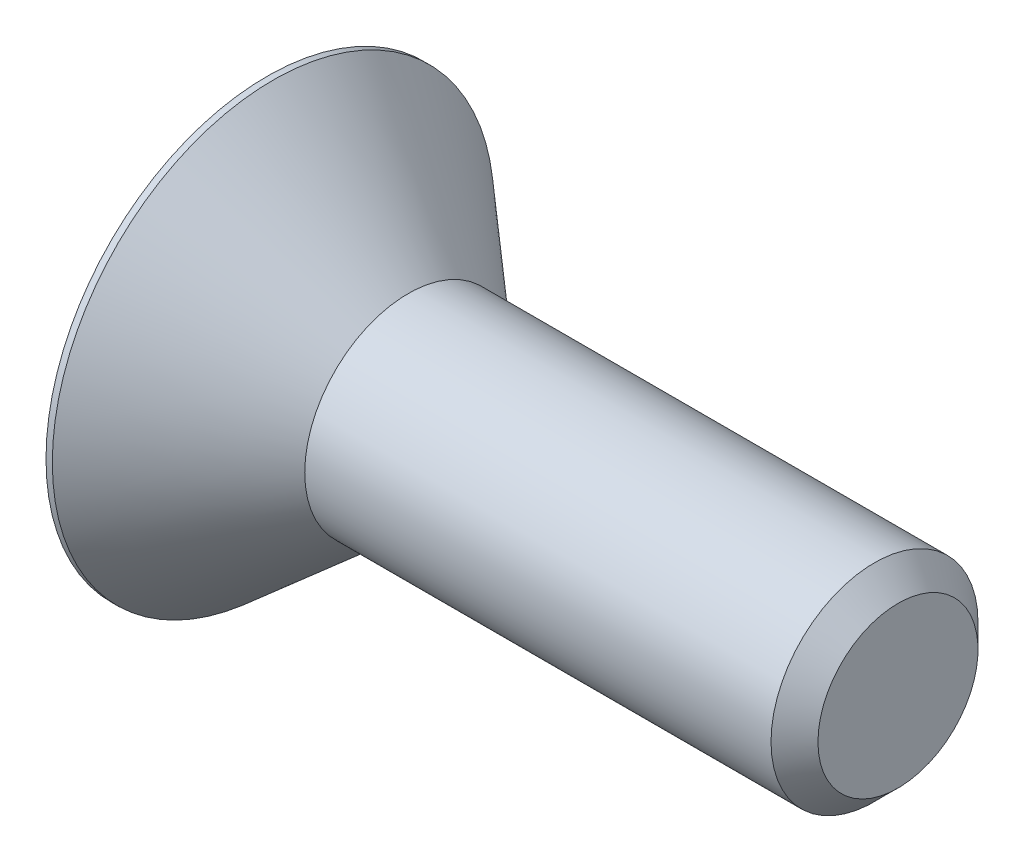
ISO-10303-21;
HEADER;
FILE_DESCRIPTION(('STEP AP214'),'2;1');
FILE_NAME('part.step','',(''),(''),'','','');
FILE_SCHEMA(('AUTOMOTIVE_DESIGN { 1 0 10303 214 1 1 1 1 }'));
ENDSEC;
DATA;
#1=APPLICATION_CONTEXT('core data for automotive mechanical design processes');
#2=APPLICATION_PROTOCOL_DEFINITION('international standard','automotive_design',2000,#1);
#3=PRODUCT_CONTEXT('',#1,'mechanical');
#4=PRODUCT('Part','Part','',(#3));
#5=PRODUCT_RELATED_PRODUCT_CATEGORY('part','',(#4));
#6=PRODUCT_DEFINITION_FORMATION('','',#4);
#7=PRODUCT_DEFINITION_CONTEXT('part definition',#1,'design');
#8=PRODUCT_DEFINITION('design','',#6,#7);
#9=PRODUCT_DEFINITION_SHAPE('','',#8);
#10=(LENGTH_UNIT() NAMED_UNIT(*) SI_UNIT(.MILLI.,.METRE.));
#11=(NAMED_UNIT(*) PLANE_ANGLE_UNIT() SI_UNIT($,.RADIAN.));
#12=(NAMED_UNIT(*) SI_UNIT($,.STERADIAN.) SOLID_ANGLE_UNIT());
#13=UNCERTAINTY_MEASURE_WITH_UNIT(LENGTH_MEASURE(1.E-05),#10,'distance_accuracy_value','');
#14=(GEOMETRIC_REPRESENTATION_CONTEXT(3) GLOBAL_UNCERTAINTY_ASSIGNED_CONTEXT((#13)) GLOBAL_UNIT_ASSIGNED_CONTEXT((#10,
#11,#12)) REPRESENTATION_CONTEXT('',''));
#15=CARTESIAN_POINT('',(0.,0.,0.));
#16=DIRECTION('',(0.,0.,1.));
#17=DIRECTION('',(1.,0.,0.));
#18=AXIS2_PLACEMENT_3D('',#15,#16,#17);
#19=CARTESIAN_POINT('',(0.,0.,0.));
#20=DIRECTION('',(-1.,0.,0.));
#21=DIRECTION('',(0.,0.,1.));
#22=AXIS2_PLACEMENT_3D('',#19,#20,#21);
#23=PLANE('',#22);
#24=CARTESIAN_POINT('',(0.,0.,0.));
#25=DIRECTION('',(-1.,0.,0.));
#26=DIRECTION('',(0.,0.,1.));
#27=AXIS2_PLACEMENT_3D('',#24,#25,#26);
#28=CIRCLE('',#27,4.445);
#29=CARTESIAN_POINT('',(0.,0.,4.445));
#30=VERTEX_POINT('',#29);
#31=EDGE_CURVE('E11',#30,#30,#28,.T.);
#32=ORIENTED_EDGE('',*,*,#31,.T.);
#33=EDGE_LOOP('',(#32));
#34=FACE_BOUND('',#33,.T.);
#35=DIRECTION('',(0.,-0.5,-0.866025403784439));
#36=VECTOR('',#35,1.);
#37=CARTESIAN_POINT('',(0.,-0.689240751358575,1.1938));
#38=LINE('',#37,#36);
#39=CARTESIAN_POINT('',(0.,-0.689240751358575,1.1938));
#40=VERTEX_POINT('',#39);
#41=CARTESIAN_POINT('',(0.,-1.37848150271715,0.));
#42=VERTEX_POINT('',#41);
#43=EDGE_CURVE('E116',#40,#42,#38,.T.);
#44=ORIENTED_EDGE('',*,*,#43,.T.);
#45=DIRECTION('',(0.,0.5,-0.866025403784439));
#46=VECTOR('',#45,1.);
#47=CARTESIAN_POINT('',(0.,-1.37848150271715,0.));
#48=LINE('',#47,#46);
#49=CARTESIAN_POINT('',(0.,-0.689240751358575,-1.1938));
#50=VERTEX_POINT('',#49);
#51=EDGE_CURVE('E47',#42,#50,#48,.T.);
#52=ORIENTED_EDGE('',*,*,#51,.T.);
#53=DIRECTION('',(0.,1.,0.));
#54=VECTOR('',#53,1.);
#55=CARTESIAN_POINT('',(0.,-0.689240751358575,-1.1938));
#56=LINE('',#55,#54);
#57=CARTESIAN_POINT('',(0.,0.689240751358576,-1.1938));
#58=VERTEX_POINT('',#57);
#59=EDGE_CURVE('E127',#50,#58,#56,.T.);
#60=ORIENTED_EDGE('',*,*,#59,.T.);
#61=DIRECTION('',(0.,0.5,0.866025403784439));
#62=VECTOR('',#61,1.);
#63=CARTESIAN_POINT('',(0.,0.689240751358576,-1.1938));
#64=LINE('',#63,#62);
#65=CARTESIAN_POINT('',(0.,1.37848150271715,0.));
#66=VERTEX_POINT('',#65);
#67=EDGE_CURVE('E198',#58,#66,#64,.T.);
#68=ORIENTED_EDGE('',*,*,#67,.T.);
#69=DIRECTION('',(0.,-0.5,0.866025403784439));
#70=VECTOR('',#69,1.);
#71=CARTESIAN_POINT('',(0.,1.37848150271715,0.));
#72=LINE('',#71,#70);
#73=CARTESIAN_POINT('',(0.,0.689240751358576,1.1938));
#74=VERTEX_POINT('',#73);
#75=EDGE_CURVE('E181',#66,#74,#72,.T.);
#76=ORIENTED_EDGE('',*,*,#75,.T.);
#77=DIRECTION('',(0.,-1.,0.));
#78=VECTOR('',#77,1.);
#79=CARTESIAN_POINT('',(0.,0.689240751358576,1.1938));
#80=LINE('',#79,#78);
#81=EDGE_CURVE('E176',#74,#40,#80,.T.);
#82=ORIENTED_EDGE('',*,*,#81,.T.);
#83=EDGE_LOOP('',(#44,#52,#60,#68,#76,#82));
#84=FACE_BOUND('',#83,.T.);
#85=ADVANCED_FACE('F33',(#34,#84),#23,.T.);
#86=CARTESIAN_POINT('',(0.,0.,0.));
#87=DIRECTION('',(-1.,0.,0.));
#88=DIRECTION('',(0.,0.,1.));
#89=AXIS2_PLACEMENT_3D('',#86,#87,#88);
#90=CYLINDRICAL_SURFACE('',#89,4.445);
#91=CARTESIAN_POINT('',(0.127,0.,0.));
#92=DIRECTION('',(-1.,0.,0.));
#93=DIRECTION('',(0.,0.,1.));
#94=AXIS2_PLACEMENT_3D('',#91,#92,#93);
#95=CIRCLE('',#94,4.445);
#96=CARTESIAN_POINT('',(0.127,0.,4.445));
#97=VERTEX_POINT('',#96);
#98=EDGE_CURVE('E40',#97,#97,#95,.T.);
#99=ORIENTED_EDGE('',*,*,#98,.T.);
#100=EDGE_LOOP('',(#99));
#101=FACE_BOUND('',#100,.T.);
#102=ORIENTED_EDGE('',*,*,#31,.F.);
#103=EDGE_LOOP('',(#102));
#104=FACE_BOUND('',#103,.T.);
#105=ADVANCED_FACE('F152',(#101,#104),#90,.T.);
#106=CARTESIAN_POINT('',(0.127,0.,0.));
#107=DIRECTION('',(-1.,0.,0.));
#108=DIRECTION('',(0.,0.,1.));
#109=AXIS2_PLACEMENT_3D('',#106,#107,#108);
#110=CONICAL_SURFACE('',#109,4.445,0.715584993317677);
#111=CARTESIAN_POINT('',(2.84440025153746,0.,0.));
#112=DIRECTION('',(-1.,0.,0.));
#113=DIRECTION('',(0.,0.,1.));
#114=AXIS2_PLACEMENT_3D('',#111,#112,#113);
#115=CIRCLE('',#114,2.0828);
#116=CARTESIAN_POINT('',(2.84440025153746,0.,2.0828));
#117=VERTEX_POINT('',#116);
#118=EDGE_CURVE('E147',#117,#117,#115,.T.);
#119=ORIENTED_EDGE('',*,*,#118,.T.);
#120=EDGE_LOOP('',(#119));
#121=FACE_BOUND('',#120,.T.);
#122=ORIENTED_EDGE('',*,*,#98,.F.);
#123=EDGE_LOOP('',(#122));
#124=FACE_BOUND('',#123,.T.);
#125=ADVANCED_FACE('F155',(#121,#124),#110,.T.);
#126=CARTESIAN_POINT('',(0.,0.,0.));
#127=DIRECTION('',(-1.,0.,0.));
#128=DIRECTION('',(0.,0.,1.));
#129=AXIS2_PLACEMENT_3D('',#126,#127,#128);
#130=CYLINDRICAL_SURFACE('',#129,2.08279999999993);
#131=CARTESIAN_POINT('',(12.2275599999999,0.,0.));
#132=DIRECTION('',(-1.,0.,0.));
#133=DIRECTION('',(0.,0.,1.));
#134=AXIS2_PLACEMENT_3D('',#131,#132,#133);
#135=CIRCLE('',#134,2.08279999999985);
#136=CARTESIAN_POINT('',(12.2275599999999,0.,2.08279999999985));
#137=VERTEX_POINT('',#136);
#138=EDGE_CURVE('E144',#137,#137,#135,.T.);
#139=ORIENTED_EDGE('',*,*,#138,.T.);
#140=EDGE_LOOP('',(#139));
#141=FACE_BOUND('',#140,.T.);
#142=ORIENTED_EDGE('',*,*,#118,.F.);
#143=EDGE_LOOP('',(#142));
#144=FACE_BOUND('',#143,.T.);
#145=ADVANCED_FACE('F157',(#141,#144),#130,.T.);
#146=CARTESIAN_POINT('',(12.7,0.,0.));
#147=DIRECTION('',(-1.,0.,0.));
#148=DIRECTION('',(0.,0.,1.));
#149=AXIS2_PLACEMENT_3D('',#146,#147,#148);
#150=CONICAL_SURFACE('',#149,1.61036,0.785398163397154);
#151=ORIENTED_EDGE('',*,*,#138,.F.);
#152=EDGE_LOOP('',(#151));
#153=FACE_BOUND('',#152,.T.);
#154=CARTESIAN_POINT('',(12.7,0.,0.));
#155=DIRECTION('',(-1.,0.,0.));
#156=DIRECTION('',(0.,0.,1.));
#157=AXIS2_PLACEMENT_3D('',#154,#155,#156);
#158=CIRCLE('',#157,1.61036);
#159=CARTESIAN_POINT('',(12.7,0.,1.61036));
#160=VERTEX_POINT('',#159);
#161=EDGE_CURVE('E140',#160,#160,#158,.T.);
#162=ORIENTED_EDGE('',*,*,#161,.T.);
#163=EDGE_LOOP('',(#162));
#164=FACE_BOUND('',#163,.T.);
#165=ADVANCED_FACE('F164',(#153,#164),#150,.T.);
#166=CARTESIAN_POINT('',(12.7,1.61036,0.));
#167=DIRECTION('',(1.,0.,0.));
#168=DIRECTION('',(0.,0.,-1.));
#169=AXIS2_PLACEMENT_3D('',#166,#167,#168);
#170=PLANE('',#169);
#171=ORIENTED_EDGE('',*,*,#161,.F.);
#172=EDGE_LOOP('',(#171));
#173=FACE_BOUND('',#172,.T.);
#174=ADVANCED_FACE('F264',(#173),#170,.T.);
#175=CARTESIAN_POINT('',(1.9304,-1.37848150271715,0.));
#176=DIRECTION('',(0.,0.866025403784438,0.5));
#177=DIRECTION('',(0.,-0.5,0.866025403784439));
#178=AXIS2_PLACEMENT_3D('',#175,#176,#177);
#179=PLANE('',#178);
#180=ORIENTED_EDGE('',*,*,#51,.F.);
#181=DIRECTION('',(-1.,0.,0.));
#182=VECTOR('',#181,1.);
#183=CARTESIAN_POINT('',(1.9304,-1.37848150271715,0.));
#184=LINE('',#183,#182);
#185=CARTESIAN_POINT('',(1.9304,-1.37848150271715,0.));
#186=VERTEX_POINT('',#185);
#187=EDGE_CURVE('E185',#186,#42,#184,.T.);
#188=ORIENTED_EDGE('',*,*,#187,.F.);
#189=DIRECTION('',(0.,0.5,-0.866025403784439));
#190=VECTOR('',#189,1.);
#191=CARTESIAN_POINT('',(1.9304,-1.37848150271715,0.));
#192=LINE('',#191,#190);
#193=CARTESIAN_POINT('',(1.9304,-1.03386112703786,-0.5969));
#194=VERTEX_POINT('',#193);
#195=EDGE_CURVE('E112',#186,#194,#192,.T.);
#196=ORIENTED_EDGE('',*,*,#195,.T.);
#197=CARTESIAN_POINT('',(1.9304,-0.689240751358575,-1.1938));
#198=VERTEX_POINT('',#197);
#199=EDGE_CURVE('E108',#194,#198,#192,.T.);
#200=ORIENTED_EDGE('',*,*,#199,.T.);
#201=DIRECTION('',(-1.,0.,0.));
#202=VECTOR('',#201,1.);
#203=CARTESIAN_POINT('',(1.9304,-0.689240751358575,-1.1938));
#204=LINE('',#203,#202);
#205=EDGE_CURVE('E110',#198,#50,#204,.T.);
#206=ORIENTED_EDGE('',*,*,#205,.T.);
#207=EDGE_LOOP('',(#180,#188,#196,#200,#206));
#208=FACE_BOUND('',#207,.T.);
#209=ADVANCED_FACE('F109',(#208),#179,.T.);
#210=CARTESIAN_POINT('',(1.9304,-0.689240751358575,-1.1938));
#211=DIRECTION('',(0.,0.,1.));
#212=DIRECTION('',(1.,0.,0.));
#213=AXIS2_PLACEMENT_3D('',#210,#211,#212);
#214=PLANE('',#213);
#215=ORIENTED_EDGE('',*,*,#59,.F.);
#216=ORIENTED_EDGE('',*,*,#205,.F.);
#217=DIRECTION('',(0.,1.,0.));
#218=VECTOR('',#217,1.);
#219=CARTESIAN_POINT('',(1.9304,-0.689240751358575,-1.1938));
#220=LINE('',#219,#218);
#221=CARTESIAN_POINT('',(1.9304,0.,-1.1938));
#222=VERTEX_POINT('',#221);
#223=EDGE_CURVE('E55',#198,#222,#220,.T.);
#224=ORIENTED_EDGE('',*,*,#223,.T.);
#225=CARTESIAN_POINT('',(1.9304,0.689240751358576,-1.1938));
#226=VERTEX_POINT('',#225);
#227=EDGE_CURVE('E122',#222,#226,#220,.T.);
#228=ORIENTED_EDGE('',*,*,#227,.T.);
#229=DIRECTION('',(-1.,0.,0.));
#230=VECTOR('',#229,1.);
#231=CARTESIAN_POINT('',(1.9304,0.689240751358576,-1.1938));
#232=LINE('',#231,#230);
#233=EDGE_CURVE('E129',#226,#58,#232,.T.);
#234=ORIENTED_EDGE('',*,*,#233,.T.);
#235=EDGE_LOOP('',(#215,#216,#224,#228,#234));
#236=FACE_BOUND('',#235,.T.);
#237=ADVANCED_FACE('F124',(#236),#214,.T.);
#238=CARTESIAN_POINT('',(1.9304,0.689240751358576,-1.1938));
#239=DIRECTION('',(0.,-0.866025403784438,0.5));
#240=DIRECTION('',(0.,-0.5,-0.866025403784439));
#241=AXIS2_PLACEMENT_3D('',#238,#239,#240);
#242=PLANE('',#241);
#243=ORIENTED_EDGE('',*,*,#67,.F.);
#244=ORIENTED_EDGE('',*,*,#233,.F.);
#245=DIRECTION('',(0.,0.5,0.866025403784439));
#246=VECTOR('',#245,1.);
#247=CARTESIAN_POINT('',(1.9304,0.689240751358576,-1.1938));
#248=LINE('',#247,#246);
#249=CARTESIAN_POINT('',(1.9304,1.03386112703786,-0.5969));
#250=VERTEX_POINT('',#249);
#251=EDGE_CURVE('E218',#226,#250,#248,.T.);
#252=ORIENTED_EDGE('',*,*,#251,.T.);
#253=CARTESIAN_POINT('',(1.9304,1.37848150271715,0.));
#254=VERTEX_POINT('',#253);
#255=EDGE_CURVE('E121',#250,#254,#248,.T.);
#256=ORIENTED_EDGE('',*,*,#255,.T.);
#257=DIRECTION('',(-1.,0.,0.));
#258=VECTOR('',#257,1.);
#259=CARTESIAN_POINT('',(1.9304,1.37848150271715,0.));
#260=LINE('',#259,#258);
#261=EDGE_CURVE('E135',#254,#66,#260,.T.);
#262=ORIENTED_EDGE('',*,*,#261,.T.);
#263=EDGE_LOOP('',(#243,#244,#252,#256,#262));
#264=FACE_BOUND('',#263,.T.);
#265=ADVANCED_FACE('F196',(#264),#242,.T.);
#266=CARTESIAN_POINT('',(1.9304,1.37848150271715,0.));
#267=DIRECTION('',(0.,-0.866025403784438,-0.5));
#268=DIRECTION('',(0.,0.5,-0.866025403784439));
#269=AXIS2_PLACEMENT_3D('',#266,#267,#268);
#270=PLANE('',#269);
#271=ORIENTED_EDGE('',*,*,#75,.F.);
#272=ORIENTED_EDGE('',*,*,#261,.F.);
#273=DIRECTION('',(0.,-0.5,0.866025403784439));
#274=VECTOR('',#273,1.);
#275=CARTESIAN_POINT('',(1.9304,1.37848150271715,0.));
#276=LINE('',#275,#274);
#277=CARTESIAN_POINT('',(1.9304,1.03386112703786,0.5969));
#278=VERTEX_POINT('',#277);
#279=EDGE_CURVE('E215',#254,#278,#276,.T.);
#280=ORIENTED_EDGE('',*,*,#279,.T.);
#281=CARTESIAN_POINT('',(1.9304,0.689240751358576,1.1938));
#282=VERTEX_POINT('',#281);
#283=EDGE_CURVE('E217',#278,#282,#276,.T.);
#284=ORIENTED_EDGE('',*,*,#283,.T.);
#285=DIRECTION('',(-1.,0.,0.));
#286=VECTOR('',#285,1.);
#287=CARTESIAN_POINT('',(1.9304,0.689240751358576,1.1938));
#288=LINE('',#287,#286);
#289=EDGE_CURVE('E190',#282,#74,#288,.T.);
#290=ORIENTED_EDGE('',*,*,#289,.T.);
#291=EDGE_LOOP('',(#271,#272,#280,#284,#290));
#292=FACE_BOUND('',#291,.T.);
#293=ADVANCED_FACE('F228',(#292),#270,.T.);
#294=CARTESIAN_POINT('',(1.9304,0.689240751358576,1.1938));
#295=DIRECTION('',(0.,0.,-1.));
#296=DIRECTION('',(-1.,0.,0.));
#297=AXIS2_PLACEMENT_3D('',#294,#295,#296);
#298=PLANE('',#297);
#299=ORIENTED_EDGE('',*,*,#81,.F.);
#300=ORIENTED_EDGE('',*,*,#289,.F.);
#301=DIRECTION('',(0.,-1.,0.));
#302=VECTOR('',#301,1.);
#303=CARTESIAN_POINT('',(1.9304,0.689240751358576,1.1938));
#304=LINE('',#303,#302);
#305=CARTESIAN_POINT('',(1.9304,0.,1.1938));
#306=VERTEX_POINT('',#305);
#307=EDGE_CURVE('E211',#282,#306,#304,.T.);
#308=ORIENTED_EDGE('',*,*,#307,.T.);
#309=CARTESIAN_POINT('',(1.9304,-0.689240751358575,1.1938));
#310=VERTEX_POINT('',#309);
#311=EDGE_CURVE('E214',#306,#310,#304,.T.);
#312=ORIENTED_EDGE('',*,*,#311,.T.);
#313=DIRECTION('',(-1.,0.,0.));
#314=VECTOR('',#313,1.);
#315=CARTESIAN_POINT('',(1.9304,-0.689240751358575,1.1938));
#316=LINE('',#315,#314);
#317=EDGE_CURVE('E187',#310,#40,#316,.T.);
#318=ORIENTED_EDGE('',*,*,#317,.T.);
#319=EDGE_LOOP('',(#299,#300,#308,#312,#318));
#320=FACE_BOUND('',#319,.T.);
#321=ADVANCED_FACE('F241',(#320),#298,.T.);
#322=CARTESIAN_POINT('',(1.9304,-0.689240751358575,1.1938));
#323=DIRECTION('',(0.,0.866025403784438,-0.5));
#324=DIRECTION('',(0.,0.5,0.866025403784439));
#325=AXIS2_PLACEMENT_3D('',#322,#323,#324);
#326=PLANE('',#325);
#327=ORIENTED_EDGE('',*,*,#43,.F.);
#328=ORIENTED_EDGE('',*,*,#317,.F.);
#329=DIRECTION('',(0.,-0.5,-0.866025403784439));
#330=VECTOR('',#329,1.);
#331=CARTESIAN_POINT('',(1.9304,-0.689240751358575,1.1938));
#332=LINE('',#331,#330);
#333=CARTESIAN_POINT('',(1.9304,-1.03386112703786,0.5969));
#334=VERTEX_POINT('',#333);
#335=EDGE_CURVE('E188',#310,#334,#332,.T.);
#336=ORIENTED_EDGE('',*,*,#335,.T.);
#337=EDGE_CURVE('E210',#334,#186,#332,.T.);
#338=ORIENTED_EDGE('',*,*,#337,.T.);
#339=ORIENTED_EDGE('',*,*,#187,.T.);
#340=EDGE_LOOP('',(#327,#328,#336,#338,#339));
#341=FACE_BOUND('',#340,.T.);
#342=ADVANCED_FACE('F242',(#341),#326,.T.);
#343=CARTESIAN_POINT('',(1.9304,0.,-2.3876));
#344=DIRECTION('',(1.,0.,0.));
#345=DIRECTION('',(0.,0.,-1.));
#346=AXIS2_PLACEMENT_3D('',#343,#344,#345);
#347=PLANE('',#346);
#348=ORIENTED_EDGE('',*,*,#223,.F.);
#349=ORIENTED_EDGE('',*,*,#199,.F.);
#350=CARTESIAN_POINT('',(1.9304,0.,0.));
#351=DIRECTION('',(-1.,0.,0.));
#352=DIRECTION('',(0.,0.,1.));
#353=AXIS2_PLACEMENT_3D('',#350,#351,#352);
#354=CIRCLE('',#353,1.1938);
#355=EDGE_CURVE('E119',#222,#194,#354,.T.);
#356=ORIENTED_EDGE('',*,*,#355,.F.);
#357=EDGE_LOOP('',(#348,#349,#356));
#358=FACE_BOUND('',#357,.T.);
#359=ADVANCED_FACE('F118',(#358),#347,.F.);
#360=ORIENTED_EDGE('',*,*,#195,.F.);
#361=ORIENTED_EDGE('',*,*,#337,.F.);
#362=EDGE_CURVE('E132',#194,#334,#354,.T.);
#363=ORIENTED_EDGE('',*,*,#362,.F.);
#364=EDGE_LOOP('',(#360,#361,#363));
#365=FACE_BOUND('',#364,.T.);
#366=ADVANCED_FACE('F244',(#365),#347,.F.);
#367=ORIENTED_EDGE('',*,*,#335,.F.);
#368=ORIENTED_EDGE('',*,*,#311,.F.);
#369=EDGE_CURVE('E128',#334,#306,#354,.T.);
#370=ORIENTED_EDGE('',*,*,#369,.F.);
#371=EDGE_LOOP('',(#367,#368,#370));
#372=FACE_BOUND('',#371,.T.);
#373=ADVANCED_FACE('F238',(#372),#347,.F.);
#374=ORIENTED_EDGE('',*,*,#307,.F.);
#375=ORIENTED_EDGE('',*,*,#283,.F.);
#376=EDGE_CURVE('E134',#306,#278,#354,.T.);
#377=ORIENTED_EDGE('',*,*,#376,.F.);
#378=EDGE_LOOP('',(#374,#375,#377));
#379=FACE_BOUND('',#378,.T.);
#380=ADVANCED_FACE('F235',(#379),#347,.F.);
#381=ORIENTED_EDGE('',*,*,#279,.F.);
#382=ORIENTED_EDGE('',*,*,#255,.F.);
#383=EDGE_CURVE('E141',#278,#250,#354,.T.);
#384=ORIENTED_EDGE('',*,*,#383,.F.);
#385=EDGE_LOOP('',(#381,#382,#384));
#386=FACE_BOUND('',#385,.T.);
#387=ADVANCED_FACE('F226',(#386),#347,.F.);
#388=ORIENTED_EDGE('',*,*,#251,.F.);
#389=ORIENTED_EDGE('',*,*,#227,.F.);
#390=EDGE_CURVE('E223',#250,#222,#354,.T.);
#391=ORIENTED_EDGE('',*,*,#390,.F.);
#392=EDGE_LOOP('',(#388,#389,#391));
#393=FACE_BOUND('',#392,.T.);
#394=ADVANCED_FACE('F222',(#393),#347,.F.);
#395=CARTESIAN_POINT('',(1.9304,0.,0.));
#396=DIRECTION('',(-1.,0.,0.));
#397=DIRECTION('',(0.,0.,1.));
#398=AXIS2_PLACEMENT_3D('',#395,#396,#397);
#399=CONICAL_SURFACE('',#398,1.1938,1.04719755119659);
#400=CARTESIAN_POINT('',(2.61964075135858,0.,0.));
#401=VERTEX_POINT('',#400);
#402=VERTEX_LOOP('',#401);
#403=FACE_BOUND('',#402,.T.);
#404=ORIENTED_EDGE('',*,*,#376,.T.);
#405=ORIENTED_EDGE('',*,*,#383,.T.);
#406=ORIENTED_EDGE('',*,*,#390,.T.);
#407=ORIENTED_EDGE('',*,*,#355,.T.);
#408=ORIENTED_EDGE('',*,*,#362,.T.);
#409=ORIENTED_EDGE('',*,*,#369,.T.);
#410=EDGE_LOOP('',(#404,#405,#406,#407,#408,#409));
#411=FACE_BOUND('',#410,.T.);
#412=ADVANCED_FACE('F230',(#403,#411),#399,.F.);
#413=CLOSED_SHELL('',(#85,#105,#125,#145,#165,#174,#209,#237,#265,#293,#321,#342,#359,#366,#373,
#380,#387,#394,#412));
#414=MANIFOLD_SOLID_BREP('B2',#413);
#415=ADVANCED_BREP_SHAPE_REPRESENTATION('',(#18,#414),#14);
#416=SHAPE_DEFINITION_REPRESENTATION(#9,#415);
ENDSEC;
END-ISO-10303-21;
